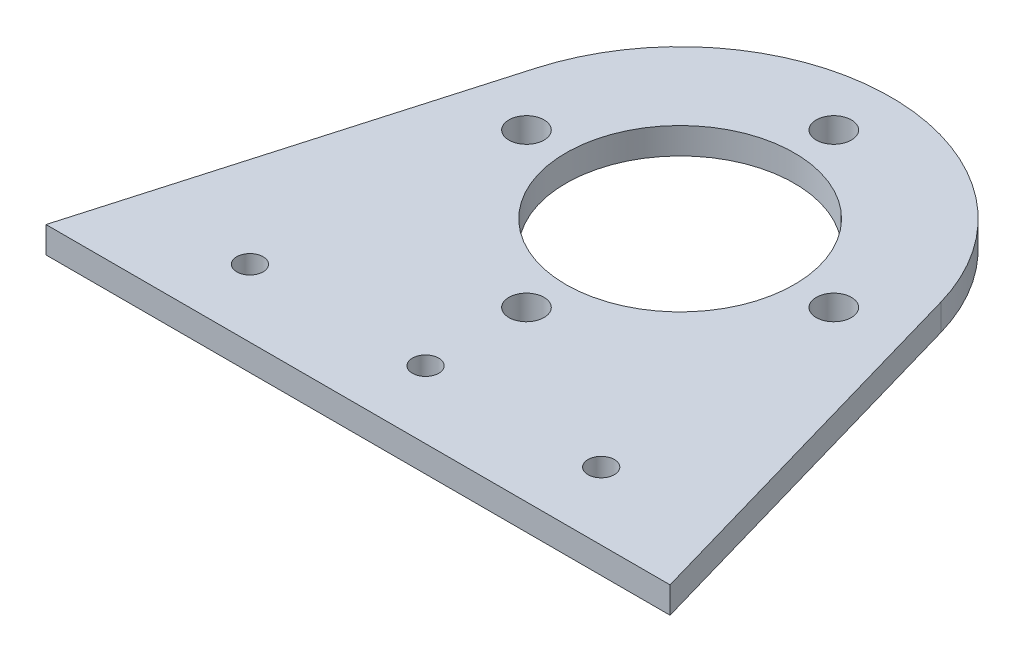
ISO-10303-21;
HEADER;
FILE_DESCRIPTION(('STEP AP214'),'2;1');
FILE_NAME('part.step','',(''),(''),'','','');
FILE_SCHEMA(('AUTOMOTIVE_DESIGN { 1 0 10303 214 1 1 1 1 }'));
ENDSEC;
DATA;
#1=APPLICATION_CONTEXT('core data for automotive mechanical design processes');
#2=APPLICATION_PROTOCOL_DEFINITION('international standard','automotive_design',2000,#1);
#3=PRODUCT_CONTEXT('',#1,'mechanical');
#4=PRODUCT('Part','Part','',(#3));
#5=PRODUCT_RELATED_PRODUCT_CATEGORY('part','',(#4));
#6=PRODUCT_DEFINITION_FORMATION('','',#4);
#7=PRODUCT_DEFINITION_CONTEXT('part definition',#1,'design');
#8=PRODUCT_DEFINITION('design','',#6,#7);
#9=PRODUCT_DEFINITION_SHAPE('','',#8);
#10=(LENGTH_UNIT() NAMED_UNIT(*) SI_UNIT(.MILLI.,.METRE.));
#11=(NAMED_UNIT(*) PLANE_ANGLE_UNIT() SI_UNIT($,.RADIAN.));
#12=(NAMED_UNIT(*) SI_UNIT($,.STERADIAN.) SOLID_ANGLE_UNIT());
#13=UNCERTAINTY_MEASURE_WITH_UNIT(LENGTH_MEASURE(1.E-05),#10,'distance_accuracy_value','');
#14=(GEOMETRIC_REPRESENTATION_CONTEXT(3) GLOBAL_UNCERTAINTY_ASSIGNED_CONTEXT((#13)) GLOBAL_UNIT_ASSIGNED_CONTEXT((#10,
#11,#12)) REPRESENTATION_CONTEXT('',''));
#15=CARTESIAN_POINT('',(0.,0.,0.));
#16=DIRECTION('',(0.,0.,1.));
#17=DIRECTION('',(1.,0.,0.));
#18=AXIS2_PLACEMENT_3D('',#15,#16,#17);
#19=CARTESIAN_POINT('',(19.2295618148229,3.,-1.79291410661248));
#20=DIRECTION('',(0.,1.,0.));
#21=DIRECTION('',(0.,0.,1.));
#22=AXIS2_PLACEMENT_3D('',#19,#20,#21);
#23=PLANE('',#22);
#24=CARTESIAN_POINT('',(19.2295618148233,3.,15.7070858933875));
#25=DIRECTION('',(0.,1.,0.));
#26=DIRECTION('',(0.,0.,1.));
#27=AXIS2_PLACEMENT_3D('',#24,#25,#26);
#28=CIRCLE('',#27,2.);
#29=CARTESIAN_POINT('',(19.2295618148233,3.,17.7070858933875));
#30=VERTEX_POINT('',#29);
#31=EDGE_CURVE('E147',#30,#30,#28,.T.);
#32=ORIENTED_EDGE('',*,*,#31,.F.);
#33=EDGE_LOOP('',(#32));
#34=FACE_BOUND('',#33,.T.);
#35=CARTESIAN_POINT('',(19.2295618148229,3.,-19.2929141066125));
#36=DIRECTION('',(0.,1.,0.));
#37=DIRECTION('',(0.,0.,1.));
#38=AXIS2_PLACEMENT_3D('',#35,#36,#37);
#39=CIRCLE('',#38,2.);
#40=CARTESIAN_POINT('',(19.2295618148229,3.,-17.2929141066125));
#41=VERTEX_POINT('',#40);
#42=EDGE_CURVE('E135',#41,#41,#39,.T.);
#43=ORIENTED_EDGE('',*,*,#42,.F.);
#44=EDGE_LOOP('',(#43));
#45=FACE_BOUND('',#44,.T.);
#46=CARTESIAN_POINT('',(-0.770438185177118,3.,27.1969831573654));
#47=DIRECTION('',(0.,1.,0.));
#48=DIRECTION('',(0.,0.,1.));
#49=AXIS2_PLACEMENT_3D('',#46,#47,#48);
#50=CIRCLE('',#49,1.5);
#51=CARTESIAN_POINT('',(-0.770438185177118,3.,28.6969831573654));
#52=VERTEX_POINT('',#51);
#53=EDGE_CURVE('E123',#52,#52,#50,.T.);
#54=ORIENTED_EDGE('',*,*,#53,.F.);
#55=EDGE_LOOP('',(#54));
#56=FACE_BOUND('',#55,.T.);
#57=CARTESIAN_POINT('',(19.2295618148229,3.,-1.79291410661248));
#58=DIRECTION('',(0.,1.,0.));
#59=DIRECTION('',(0.,0.,1.));
#60=AXIS2_PLACEMENT_3D('',#57,#58,#59);
#61=CIRCLE('',#60,13.);
#62=CARTESIAN_POINT('',(19.2295618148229,3.,11.2070858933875));
#63=VERTEX_POINT('',#62);
#64=EDGE_CURVE('E102',#63,#63,#61,.T.);
#65=ORIENTED_EDGE('',*,*,#64,.F.);
#66=EDGE_LOOP('',(#65));
#67=FACE_BOUND('',#66,.T.);
#68=CARTESIAN_POINT('',(19.2295618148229,3.,-1.79291410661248));
#69=DIRECTION('',(0.,1.,0.));
#70=DIRECTION('',(0.,0.,1.));
#71=AXIS2_PLACEMENT_3D('',#68,#69,#70);
#72=CIRCLE('',#71,24.);
#73=CARTESIAN_POINT('',(42.2932577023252,3.,-8.43113163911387));
#74=VERTEX_POINT('',#73);
#75=CARTESIAN_POINT('',(-3.83413407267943,3.,-8.43113163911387));
#76=VERTEX_POINT('',#75);
#77=EDGE_CURVE('E87',#74,#76,#72,.T.);
#78=ORIENTED_EDGE('',*,*,#77,.T.);
#79=DIRECTION('',(-0.276592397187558,0.,0.96098732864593));
#80=VECTOR('',#79,1.);
#81=CARTESIAN_POINT('',(-3.83413407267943,3.,-8.43113163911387));
#82=LINE('',#81,#80);
#83=CARTESIAN_POINT('',(-16.3022861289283,3.,34.8879771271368));
#84=VERTEX_POINT('',#83);
#85=EDGE_CURVE('E82',#76,#84,#82,.T.);
#86=ORIENTED_EDGE('',*,*,#85,.T.);
#87=DIRECTION('',(1.,0.,0.));
#88=VECTOR('',#87,1.);
#89=CARTESIAN_POINT('',(-16.3022861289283,3.,34.8879771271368));
#90=LINE('',#89,#88);
#91=CARTESIAN_POINT('',(54.761409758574,3.,34.8879771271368));
#92=VERTEX_POINT('',#91);
#93=EDGE_CURVE('E85',#84,#92,#90,.T.);
#94=ORIENTED_EDGE('',*,*,#93,.T.);
#95=DIRECTION('',(-0.276592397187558,0.,-0.96098732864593));
#96=VECTOR('',#95,1.);
#97=CARTESIAN_POINT('',(54.761409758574,3.,34.8879771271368));
#98=LINE('',#97,#96);
#99=EDGE_CURVE('E52',#92,#74,#98,.T.);
#100=ORIENTED_EDGE('',*,*,#99,.T.);
#101=EDGE_LOOP('',(#78,#86,#94,#100));
#102=FACE_BOUND('',#101,.T.);
#103=CARTESIAN_POINT('',(19.2295618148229,3.,27.1969831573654));
#104=DIRECTION('',(0.,1.,0.));
#105=DIRECTION('',(0.,0.,1.));
#106=AXIS2_PLACEMENT_3D('',#103,#104,#105);
#107=CIRCLE('',#106,1.5);
#108=CARTESIAN_POINT('',(19.2295618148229,3.,28.6969831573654));
#109=VERTEX_POINT('',#108);
#110=EDGE_CURVE('E117',#109,#109,#107,.T.);
#111=ORIENTED_EDGE('',*,*,#110,.F.);
#112=EDGE_LOOP('',(#111));
#113=FACE_BOUND('',#112,.T.);
#114=CARTESIAN_POINT('',(39.2295618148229,3.,27.1969831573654));
#115=DIRECTION('',(0.,1.,0.));
#116=DIRECTION('',(0.,0.,1.));
#117=AXIS2_PLACEMENT_3D('',#114,#115,#116);
#118=CIRCLE('',#117,1.5);
#119=CARTESIAN_POINT('',(39.2295618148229,3.,28.6969831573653));
#120=VERTEX_POINT('',#119);
#121=EDGE_CURVE('E129',#120,#120,#118,.T.);
#122=ORIENTED_EDGE('',*,*,#121,.F.);
#123=EDGE_LOOP('',(#122));
#124=FACE_BOUND('',#123,.T.);
#125=CARTESIAN_POINT('',(36.7295618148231,3.,-1.79291410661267));
#126=DIRECTION('',(0.,1.,0.));
#127=DIRECTION('',(0.,0.,1.));
#128=AXIS2_PLACEMENT_3D('',#125,#126,#127);
#129=CIRCLE('',#128,2.);
#130=CARTESIAN_POINT('',(36.7295618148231,3.,0.207085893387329));
#131=VERTEX_POINT('',#130);
#132=EDGE_CURVE('E141',#131,#131,#129,.T.);
#133=ORIENTED_EDGE('',*,*,#132,.F.);
#134=EDGE_LOOP('',(#133));
#135=FACE_BOUND('',#134,.T.);
#136=CARTESIAN_POINT('',(1.72956181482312,3.,-1.79291410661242));
#137=DIRECTION('',(0.,1.,0.));
#138=DIRECTION('',(0.,0.,1.));
#139=AXIS2_PLACEMENT_3D('',#136,#137,#138);
#140=CIRCLE('',#139,2.);
#141=CARTESIAN_POINT('',(1.72956181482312,3.,0.207085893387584));
#142=VERTEX_POINT('',#141);
#143=EDGE_CURVE('E153',#142,#142,#140,.T.);
#144=ORIENTED_EDGE('',*,*,#143,.F.);
#145=EDGE_LOOP('',(#144));
#146=FACE_BOUND('',#145,.T.);
#147=ADVANCED_FACE('F35',(#34,#45,#56,#67,#102,#113,#124,#135,#146),#23,.T.);
#148=CARTESIAN_POINT('',(19.2295618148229,0.,-1.79291410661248));
#149=DIRECTION('',(0.,1.,0.));
#150=DIRECTION('',(0.,0.,1.));
#151=AXIS2_PLACEMENT_3D('',#148,#149,#150);
#152=PLANE('',#151);
#153=CARTESIAN_POINT('',(19.2295618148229,0.,-1.79291410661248));
#154=DIRECTION('',(0.,1.,0.));
#155=DIRECTION('',(0.,0.,1.));
#156=AXIS2_PLACEMENT_3D('',#153,#154,#155);
#157=CIRCLE('',#156,24.);
#158=CARTESIAN_POINT('',(42.2932577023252,0.,-8.43113163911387));
#159=VERTEX_POINT('',#158);
#160=CARTESIAN_POINT('',(-3.83413407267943,0.,-8.43113163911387));
#161=VERTEX_POINT('',#160);
#162=EDGE_CURVE('E99',#159,#161,#157,.T.);
#163=ORIENTED_EDGE('',*,*,#162,.F.);
#164=DIRECTION('',(-0.276592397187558,0.,-0.96098732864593));
#165=VECTOR('',#164,1.);
#166=CARTESIAN_POINT('',(54.761409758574,0.,34.8879771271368));
#167=LINE('',#166,#165);
#168=CARTESIAN_POINT('',(54.761409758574,0.,34.8879771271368));
#169=VERTEX_POINT('',#168);
#170=EDGE_CURVE('E75',#169,#159,#167,.T.);
#171=ORIENTED_EDGE('',*,*,#170,.F.);
#172=DIRECTION('',(1.,0.,0.));
#173=VECTOR('',#172,1.);
#174=CARTESIAN_POINT('',(-16.3022861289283,0.,34.8879771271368));
#175=LINE('',#174,#173);
#176=CARTESIAN_POINT('',(-16.3022861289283,0.,34.8879771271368));
#177=VERTEX_POINT('',#176);
#178=EDGE_CURVE('E69',#177,#169,#175,.T.);
#179=ORIENTED_EDGE('',*,*,#178,.F.);
#180=DIRECTION('',(-0.276592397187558,0.,0.96098732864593));
#181=VECTOR('',#180,1.);
#182=CARTESIAN_POINT('',(-3.83413407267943,0.,-8.43113163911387));
#183=LINE('',#182,#181);
#184=EDGE_CURVE('E91',#161,#177,#183,.T.);
#185=ORIENTED_EDGE('',*,*,#184,.F.);
#186=EDGE_LOOP('',(#163,#171,#179,#185));
#187=FACE_BOUND('',#186,.T.);
#188=CARTESIAN_POINT('',(19.2295618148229,0.,-1.79291410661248));
#189=DIRECTION('',(0.,1.,0.));
#190=DIRECTION('',(0.,0.,1.));
#191=AXIS2_PLACEMENT_3D('',#188,#189,#190);
#192=CIRCLE('',#191,13.);
#193=CARTESIAN_POINT('',(19.2295618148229,0.,11.2070858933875));
#194=VERTEX_POINT('',#193);
#195=EDGE_CURVE('E114',#194,#194,#192,.T.);
#196=ORIENTED_EDGE('',*,*,#195,.T.);
#197=EDGE_LOOP('',(#196));
#198=FACE_BOUND('',#197,.T.);
#199=CARTESIAN_POINT('',(19.2295618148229,0.,27.1969831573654));
#200=DIRECTION('',(0.,1.,0.));
#201=DIRECTION('',(0.,0.,1.));
#202=AXIS2_PLACEMENT_3D('',#199,#200,#201);
#203=CIRCLE('',#202,1.5);
#204=CARTESIAN_POINT('',(19.2295618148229,0.,28.6969831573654));
#205=VERTEX_POINT('',#204);
#206=EDGE_CURVE('E120',#205,#205,#203,.T.);
#207=ORIENTED_EDGE('',*,*,#206,.T.);
#208=EDGE_LOOP('',(#207));
#209=FACE_BOUND('',#208,.T.);
#210=CARTESIAN_POINT('',(-0.770438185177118,0.,27.1969831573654));
#211=DIRECTION('',(0.,1.,0.));
#212=DIRECTION('',(0.,0.,1.));
#213=AXIS2_PLACEMENT_3D('',#210,#211,#212);
#214=CIRCLE('',#213,1.5);
#215=CARTESIAN_POINT('',(-0.770438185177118,0.,28.6969831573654));
#216=VERTEX_POINT('',#215);
#217=EDGE_CURVE('E126',#216,#216,#214,.T.);
#218=ORIENTED_EDGE('',*,*,#217,.T.);
#219=EDGE_LOOP('',(#218));
#220=FACE_BOUND('',#219,.T.);
#221=CARTESIAN_POINT('',(39.2295618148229,0.,27.1969831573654));
#222=DIRECTION('',(0.,1.,0.));
#223=DIRECTION('',(0.,0.,1.));
#224=AXIS2_PLACEMENT_3D('',#221,#222,#223);
#225=CIRCLE('',#224,1.5);
#226=CARTESIAN_POINT('',(39.2295618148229,0.,28.6969831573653));
#227=VERTEX_POINT('',#226);
#228=EDGE_CURVE('E132',#227,#227,#225,.T.);
#229=ORIENTED_EDGE('',*,*,#228,.T.);
#230=EDGE_LOOP('',(#229));
#231=FACE_BOUND('',#230,.T.);
#232=CARTESIAN_POINT('',(19.2295618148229,0.,-19.2929141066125));
#233=DIRECTION('',(0.,1.,0.));
#234=DIRECTION('',(0.,0.,1.));
#235=AXIS2_PLACEMENT_3D('',#232,#233,#234);
#236=CIRCLE('',#235,2.);
#237=CARTESIAN_POINT('',(19.2295618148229,0.,-17.2929141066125));
#238=VERTEX_POINT('',#237);
#239=EDGE_CURVE('E138',#238,#238,#236,.T.);
#240=ORIENTED_EDGE('',*,*,#239,.T.);
#241=EDGE_LOOP('',(#240));
#242=FACE_BOUND('',#241,.T.);
#243=CARTESIAN_POINT('',(36.7295618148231,0.,-1.79291410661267));
#244=DIRECTION('',(0.,1.,0.));
#245=DIRECTION('',(0.,0.,1.));
#246=AXIS2_PLACEMENT_3D('',#243,#244,#245);
#247=CIRCLE('',#246,2.);
#248=CARTESIAN_POINT('',(36.7295618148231,0.,0.207085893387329));
#249=VERTEX_POINT('',#248);
#250=EDGE_CURVE('E144',#249,#249,#247,.T.);
#251=ORIENTED_EDGE('',*,*,#250,.T.);
#252=EDGE_LOOP('',(#251));
#253=FACE_BOUND('',#252,.T.);
#254=CARTESIAN_POINT('',(19.2295618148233,0.,15.7070858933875));
#255=DIRECTION('',(0.,1.,0.));
#256=DIRECTION('',(0.,0.,1.));
#257=AXIS2_PLACEMENT_3D('',#254,#255,#256);
#258=CIRCLE('',#257,2.);
#259=CARTESIAN_POINT('',(19.2295618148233,0.,17.7070858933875));
#260=VERTEX_POINT('',#259);
#261=EDGE_CURVE('E150',#260,#260,#258,.T.);
#262=ORIENTED_EDGE('',*,*,#261,.T.);
#263=EDGE_LOOP('',(#262));
#264=FACE_BOUND('',#263,.T.);
#265=CARTESIAN_POINT('',(1.72956181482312,0.,-1.79291410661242));
#266=DIRECTION('',(0.,1.,0.));
#267=DIRECTION('',(0.,0.,1.));
#268=AXIS2_PLACEMENT_3D('',#265,#266,#267);
#269=CIRCLE('',#268,2.);
#270=CARTESIAN_POINT('',(1.72956181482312,0.,0.207085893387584));
#271=VERTEX_POINT('',#270);
#272=EDGE_CURVE('E156',#271,#271,#269,.T.);
#273=ORIENTED_EDGE('',*,*,#272,.T.);
#274=EDGE_LOOP('',(#273));
#275=FACE_BOUND('',#274,.T.);
#276=ADVANCED_FACE('F110',(#187,#198,#209,#220,#231,#242,#253,#264,#275),#152,.F.);
#277=CARTESIAN_POINT('',(19.2295618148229,3.,-1.79291410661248));
#278=DIRECTION('',(0.,-1.,0.));
#279=DIRECTION('',(0.,0.,-1.));
#280=AXIS2_PLACEMENT_3D('',#277,#278,#279);
#281=CYLINDRICAL_SURFACE('',#280,24.);
#282=ORIENTED_EDGE('',*,*,#162,.T.);
#283=DIRECTION('',(0.,-1.,0.));
#284=VECTOR('',#283,1.);
#285=CARTESIAN_POINT('',(-3.83413407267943,3.,-8.43113163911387));
#286=LINE('',#285,#284);
#287=EDGE_CURVE('E11',#76,#161,#286,.T.);
#288=ORIENTED_EDGE('',*,*,#287,.F.);
#289=ORIENTED_EDGE('',*,*,#77,.F.);
#290=DIRECTION('',(0.,-1.,0.));
#291=VECTOR('',#290,1.);
#292=CARTESIAN_POINT('',(42.2932577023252,3.,-8.43113163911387));
#293=LINE('',#292,#291);
#294=EDGE_CURVE('E95',#74,#159,#293,.T.);
#295=ORIENTED_EDGE('',*,*,#294,.T.);
#296=EDGE_LOOP('',(#282,#288,#289,#295));
#297=FACE_BOUND('',#296,.T.);
#298=ADVANCED_FACE('F37',(#297),#281,.T.);
#299=CARTESIAN_POINT('',(-3.83413407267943,3.,-8.43113163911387));
#300=DIRECTION('',(0.96098732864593,0.,0.276592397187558));
#301=DIRECTION('',(0.276592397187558,0.,-0.96098732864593));
#302=AXIS2_PLACEMENT_3D('',#299,#300,#301);
#303=PLANE('',#302);
#304=ORIENTED_EDGE('',*,*,#184,.T.);
#305=DIRECTION('',(0.,-1.,0.));
#306=VECTOR('',#305,1.);
#307=CARTESIAN_POINT('',(-16.3022861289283,3.,34.8879771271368));
#308=LINE('',#307,#306);
#309=EDGE_CURVE('E44',#84,#177,#308,.T.);
#310=ORIENTED_EDGE('',*,*,#309,.F.);
#311=ORIENTED_EDGE('',*,*,#85,.F.);
#312=ORIENTED_EDGE('',*,*,#287,.T.);
#313=EDGE_LOOP('',(#304,#310,#311,#312));
#314=FACE_BOUND('',#313,.T.);
#315=ADVANCED_FACE('F90',(#314),#303,.F.);
#316=CARTESIAN_POINT('',(-16.3022861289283,3.,34.8879771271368));
#317=DIRECTION('',(0.,0.,-1.));
#318=DIRECTION('',(-1.,0.,0.));
#319=AXIS2_PLACEMENT_3D('',#316,#317,#318);
#320=PLANE('',#319);
#321=ORIENTED_EDGE('',*,*,#178,.T.);
#322=DIRECTION('',(0.,-1.,0.));
#323=VECTOR('',#322,1.);
#324=CARTESIAN_POINT('',(54.761409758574,3.,34.8879771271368));
#325=LINE('',#324,#323);
#326=EDGE_CURVE('E92',#92,#169,#325,.T.);
#327=ORIENTED_EDGE('',*,*,#326,.F.);
#328=ORIENTED_EDGE('',*,*,#93,.F.);
#329=ORIENTED_EDGE('',*,*,#309,.T.);
#330=EDGE_LOOP('',(#321,#327,#328,#329));
#331=FACE_BOUND('',#330,.T.);
#332=ADVANCED_FACE('F93',(#331),#320,.F.);
#333=CARTESIAN_POINT('',(54.761409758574,3.,34.8879771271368));
#334=DIRECTION('',(-0.96098732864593,0.,0.276592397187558));
#335=DIRECTION('',(0.276592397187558,0.,0.96098732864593));
#336=AXIS2_PLACEMENT_3D('',#333,#334,#335);
#337=PLANE('',#336);
#338=ORIENTED_EDGE('',*,*,#170,.T.);
#339=ORIENTED_EDGE('',*,*,#294,.F.);
#340=ORIENTED_EDGE('',*,*,#99,.F.);
#341=ORIENTED_EDGE('',*,*,#326,.T.);
#342=EDGE_LOOP('',(#338,#339,#340,#341));
#343=FACE_BOUND('',#342,.T.);
#344=ADVANCED_FACE('F107',(#343),#337,.F.);
#345=CARTESIAN_POINT('',(19.2295618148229,3.,-1.79291410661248));
#346=DIRECTION('',(0.,-1.,0.));
#347=DIRECTION('',(0.,0.,-1.));
#348=AXIS2_PLACEMENT_3D('',#345,#346,#347);
#349=CYLINDRICAL_SURFACE('',#348,13.);
#350=ORIENTED_EDGE('',*,*,#64,.T.);
#351=EDGE_LOOP('',(#350));
#352=FACE_BOUND('',#351,.T.);
#353=ORIENTED_EDGE('',*,*,#195,.F.);
#354=EDGE_LOOP('',(#353));
#355=FACE_BOUND('',#354,.T.);
#356=ADVANCED_FACE('F175',(#352,#355),#349,.F.);
#357=CARTESIAN_POINT('',(19.2295618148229,3.,27.1969831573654));
#358=DIRECTION('',(0.,-1.,0.));
#359=DIRECTION('',(0.,0.,-1.));
#360=AXIS2_PLACEMENT_3D('',#357,#358,#359);
#361=CYLINDRICAL_SURFACE('',#360,1.5);
#362=ORIENTED_EDGE('',*,*,#110,.T.);
#363=EDGE_LOOP('',(#362));
#364=FACE_BOUND('',#363,.T.);
#365=ORIENTED_EDGE('',*,*,#206,.F.);
#366=EDGE_LOOP('',(#365));
#367=FACE_BOUND('',#366,.T.);
#368=ADVANCED_FACE('F221',(#364,#367),#361,.F.);
#369=CARTESIAN_POINT('',(-0.770438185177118,3.,27.1969831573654));
#370=DIRECTION('',(0.,-1.,0.));
#371=DIRECTION('',(0.,0.,-1.));
#372=AXIS2_PLACEMENT_3D('',#369,#370,#371);
#373=CYLINDRICAL_SURFACE('',#372,1.5);
#374=ORIENTED_EDGE('',*,*,#53,.T.);
#375=EDGE_LOOP('',(#374));
#376=FACE_BOUND('',#375,.T.);
#377=ORIENTED_EDGE('',*,*,#217,.F.);
#378=EDGE_LOOP('',(#377));
#379=FACE_BOUND('',#378,.T.);
#380=ADVANCED_FACE('F229',(#376,#379),#373,.F.);
#381=CARTESIAN_POINT('',(39.2295618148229,3.,27.1969831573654));
#382=DIRECTION('',(0.,-1.,0.));
#383=DIRECTION('',(0.,0.,-1.));
#384=AXIS2_PLACEMENT_3D('',#381,#382,#383);
#385=CYLINDRICAL_SURFACE('',#384,1.5);
#386=ORIENTED_EDGE('',*,*,#121,.T.);
#387=EDGE_LOOP('',(#386));
#388=FACE_BOUND('',#387,.T.);
#389=ORIENTED_EDGE('',*,*,#228,.F.);
#390=EDGE_LOOP('',(#389));
#391=FACE_BOUND('',#390,.T.);
#392=ADVANCED_FACE('F237',(#388,#391),#385,.F.);
#393=CARTESIAN_POINT('',(19.2295618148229,3.,-19.2929141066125));
#394=DIRECTION('',(0.,-1.,0.));
#395=DIRECTION('',(0.,0.,-1.));
#396=AXIS2_PLACEMENT_3D('',#393,#394,#395);
#397=CYLINDRICAL_SURFACE('',#396,2.);
#398=ORIENTED_EDGE('',*,*,#42,.T.);
#399=EDGE_LOOP('',(#398));
#400=FACE_BOUND('',#399,.T.);
#401=ORIENTED_EDGE('',*,*,#239,.F.);
#402=EDGE_LOOP('',(#401));
#403=FACE_BOUND('',#402,.T.);
#404=ADVANCED_FACE('F246',(#400,#403),#397,.F.);
#405=CARTESIAN_POINT('',(36.7295618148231,3.,-1.79291410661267));
#406=DIRECTION('',(0.,-1.,0.));
#407=DIRECTION('',(0.,0.,-1.));
#408=AXIS2_PLACEMENT_3D('',#405,#406,#407);
#409=CYLINDRICAL_SURFACE('',#408,2.);
#410=ORIENTED_EDGE('',*,*,#132,.T.);
#411=EDGE_LOOP('',(#410));
#412=FACE_BOUND('',#411,.T.);
#413=ORIENTED_EDGE('',*,*,#250,.F.);
#414=EDGE_LOOP('',(#413));
#415=FACE_BOUND('',#414,.T.);
#416=ADVANCED_FACE('F255',(#412,#415),#409,.F.);
#417=CARTESIAN_POINT('',(19.2295618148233,3.,15.7070858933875));
#418=DIRECTION('',(0.,-1.,0.));
#419=DIRECTION('',(0.,0.,-1.));
#420=AXIS2_PLACEMENT_3D('',#417,#418,#419);
#421=CYLINDRICAL_SURFACE('',#420,2.);
#422=ORIENTED_EDGE('',*,*,#31,.T.);
#423=EDGE_LOOP('',(#422));
#424=FACE_BOUND('',#423,.T.);
#425=ORIENTED_EDGE('',*,*,#261,.F.);
#426=EDGE_LOOP('',(#425));
#427=FACE_BOUND('',#426,.T.);
#428=ADVANCED_FACE('F264',(#424,#427),#421,.F.);
#429=CARTESIAN_POINT('',(1.72956181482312,3.,-1.79291410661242));
#430=DIRECTION('',(0.,-1.,0.));
#431=DIRECTION('',(0.,0.,-1.));
#432=AXIS2_PLACEMENT_3D('',#429,#430,#431);
#433=CYLINDRICAL_SURFACE('',#432,2.);
#434=ORIENTED_EDGE('',*,*,#143,.T.);
#435=EDGE_LOOP('',(#434));
#436=FACE_BOUND('',#435,.T.);
#437=ORIENTED_EDGE('',*,*,#272,.F.);
#438=EDGE_LOOP('',(#437));
#439=FACE_BOUND('',#438,.T.);
#440=ADVANCED_FACE('F162',(#436,#439),#433,.F.);
#441=CLOSED_SHELL('',(#147,#276,#298,#315,#332,#344,#356,#368,#380,#392,#404,#416,#428,#440));
#442=MANIFOLD_SOLID_BREP('B2',#441);
#443=ADVANCED_BREP_SHAPE_REPRESENTATION('',(#18,#442),#14);
#444=SHAPE_DEFINITION_REPRESENTATION(#9,#443);
ENDSEC;
END-ISO-10303-21;
